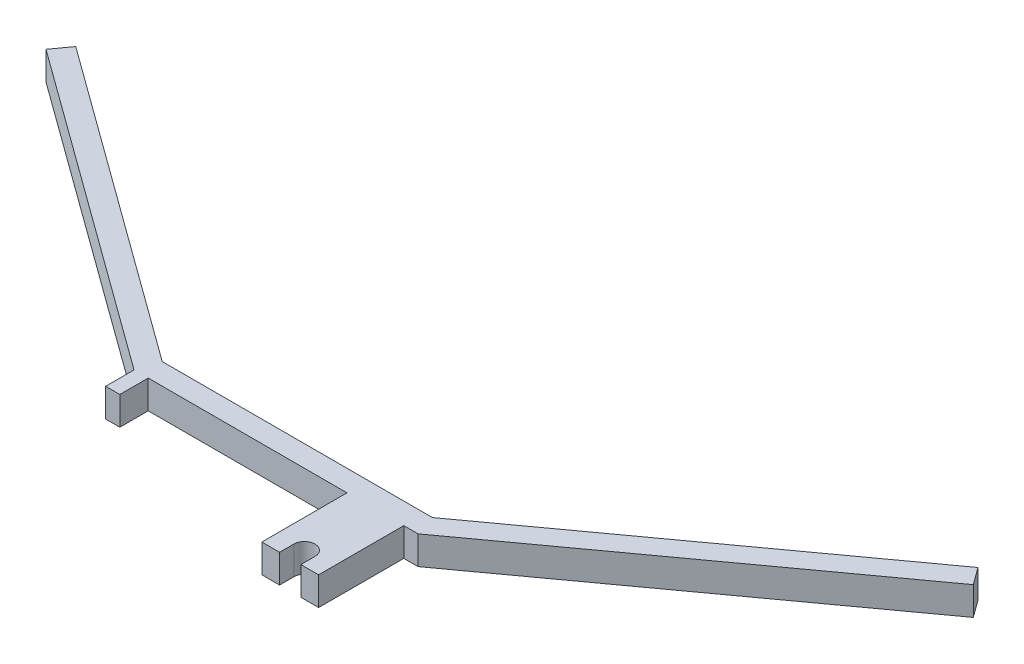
from build123d import *

# Parameters (mm, degrees)
EXTRUDE_1_DEPTH     = 1
SKETCH_2_W          = 1
SKETCH_2_H          = 2
EXTRUDE_2_DEPTH     = 2
CUT_EXTRUDE_1_DEPTH = 59.502938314
SKETCH_4_W          = 4
SKETCH_4_H          = 6
EXTRUDE_3_DEPTH     = 2
CUT_EXTRUDE_2_DEPTH = 62.859468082


with BuildPart() as part:
    # Sketch 1 → Extrude 1 (new, symmetric)
    with BuildSketch(Plane(origin=(0, 0, 0), x_dir=(1, 0, 0), z_dir=(0, 1, 0))):
        Polygon((-31.773422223, -28.831720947), (-9.512743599, -45), (9.512743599, -45), (31.773422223, -28.831720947), (32.654919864, -30.045377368), (10, -46.5), (-10, -46.5), (-32.654919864, -30.045377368), align=None)
    extrude(amount=EXTRUDE_1_DEPTH, both=True)

    # Sketch 2 → Extrude 2 (add)
    with BuildSketch(Plane(origin=(0, 1, 0), x_dir=(1, 0, 0), z_dir=(0, 1, 0))):
        with Locations((-9.5, -47.5)):
            Rectangle(SKETCH_2_W, SKETCH_2_H)
        with Locations((9.5, -47.5)):
            Rectangle(SKETCH_2_W, SKETCH_2_H)
    extrude(amount=-EXTRUDE_2_DEPTH)

    # Sketch 3 → Cut-Extrude 1 (cut, through all)
    with BuildSketch(Plane.XZ.offset(1)):
        Polygon((9, 46.5), (12.363540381, 46.5), (12.363540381, 49.607940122), (7.497349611, 49.607940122), (7.497349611, 46.5), align=None)
    extrude(amount=-CUT_EXTRUDE_1_DEPTH, mode=Mode.SUBTRACT)

    # Sketch 4 → Extrude 3 (add)
    with BuildSketch(Plane.XZ.offset(1)):
        with Locations((7, 49.5)):
            Rectangle(SKETCH_4_W, SKETCH_4_H)
    extrude(amount=-EXTRUDE_3_DEPTH)

    # Sketch 5 → Cut-Extrude 2 (cut, through all)
    with BuildSketch(Plane.XZ.offset(1)):
        with BuildLine():
            Line((6.25, 51.5), (6.25, 54.5))
            Line((6.25, 54.5), (7.75, 54.5))
            Line((7.75, 54.5), (7.75, 51.5))
            ThreePointArc((7.75, 51.5), (7, 50.75), (6.25, 51.5))
        make_face()
    extrude(amount=-CUT_EXTRUDE_2_DEPTH, mode=Mode.SUBTRACT)


solid = part.part
